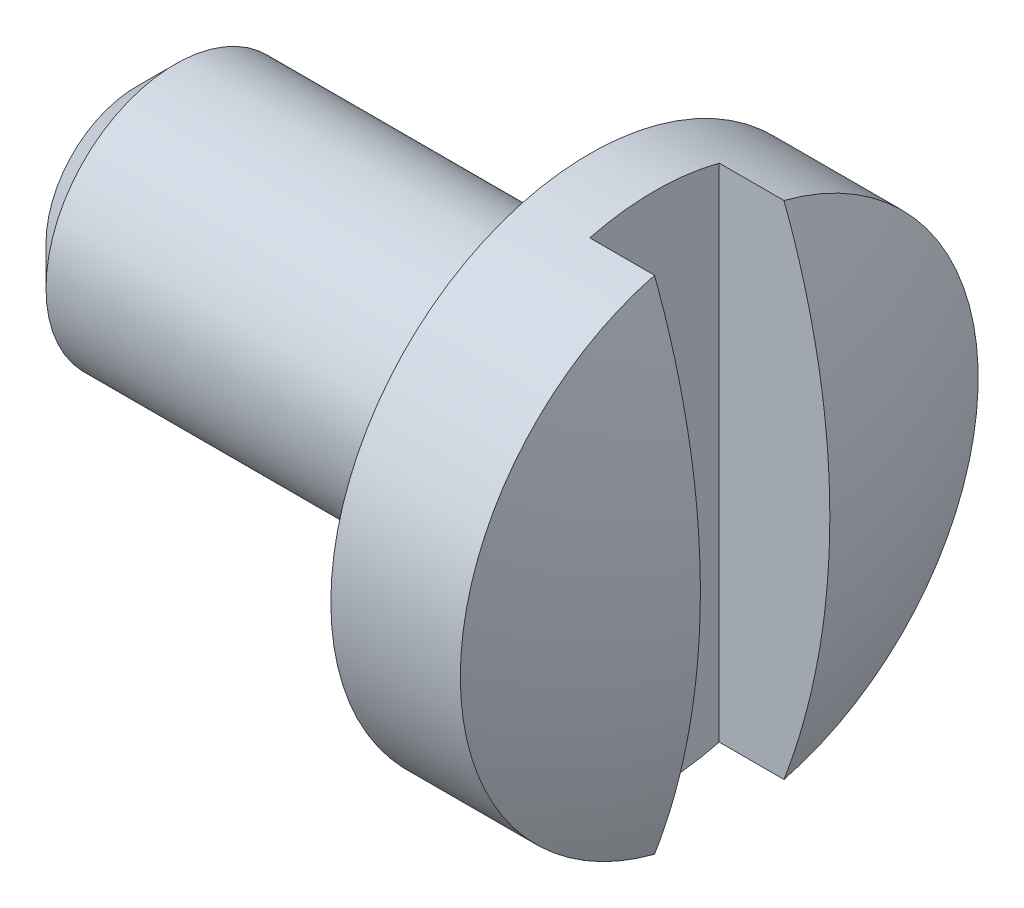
from build123d import *

# Parameters (mm, degrees)
ESQUISSE2_W             = 1
ESQUISSE2_H             = 5
ENL_V_MAT_EXTRU_1_DEPTH = 5.898979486


with BuildPart() as part:
    # Esquisse1 → R_volution1 (revolve)
    with BuildSketch(Plane.XY, mode=Mode.PRIVATE) as r_volution1_sk:
        with BuildLine():
            Line((-2.5, 0), (-2.5, 0.7))
            Line((-2.5, 0.7), (-2.2, 1))
            Line((-2.2, 1), (1, 1))
            Line((1, 1), (1, 2))
            Line((1, 2), (2, 2))
            ThreePointArc((2, 2), (2.281573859, 1.017567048), (2.376524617, 0))
            Line((2.376524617, 0), (-2.5, 0))
        make_face()
    revolve(r_volution1_sk.sketch.rotate(Axis((-3.963600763, 0, 0), (1, 0, 0)), 90), axis=Axis((-3.963600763, 0, 0), (1, 0, 0)))

    # Esquisse2 → Enl_v. mat.-Extru.1 (cut, through all)
    with BuildSketch(Plane(origin=(1.5, 0, 0), x_dir=(0, 0, -1), z_dir=(1, 0, 0))):
        Rectangle(ESQUISSE2_W, ESQUISSE2_H)
    extrude(amount=ENL_V_MAT_EXTRU_1_DEPTH, mode=Mode.SUBTRACT)


solid = part.part
